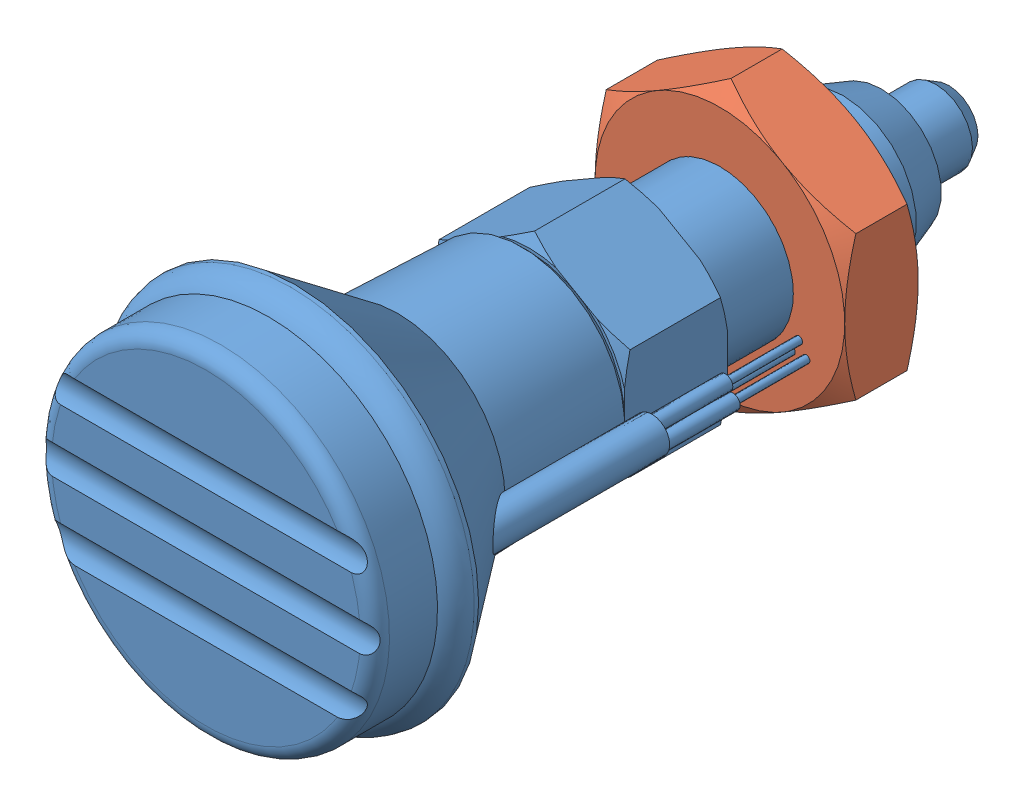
SolidWorks assembly NDX10W-S.sldasm, configuration Default (file format 15000). Lengths in mm.
Overall size (25 25 51).
2 component instances, 2 part files, 0 mates.
Components (placement in the parent):
- NDX10W-S_01-1: NDX10W-S_01.sldprt [ﾃﾞﾌｫﾙﾄ] at origin size (25 25 51)
- NDX10W-S_02-1: NDX10W-S_02.sldprt [ﾃﾞﾌｫﾙﾄ] at origin size (23.23 23.23 5.01)
